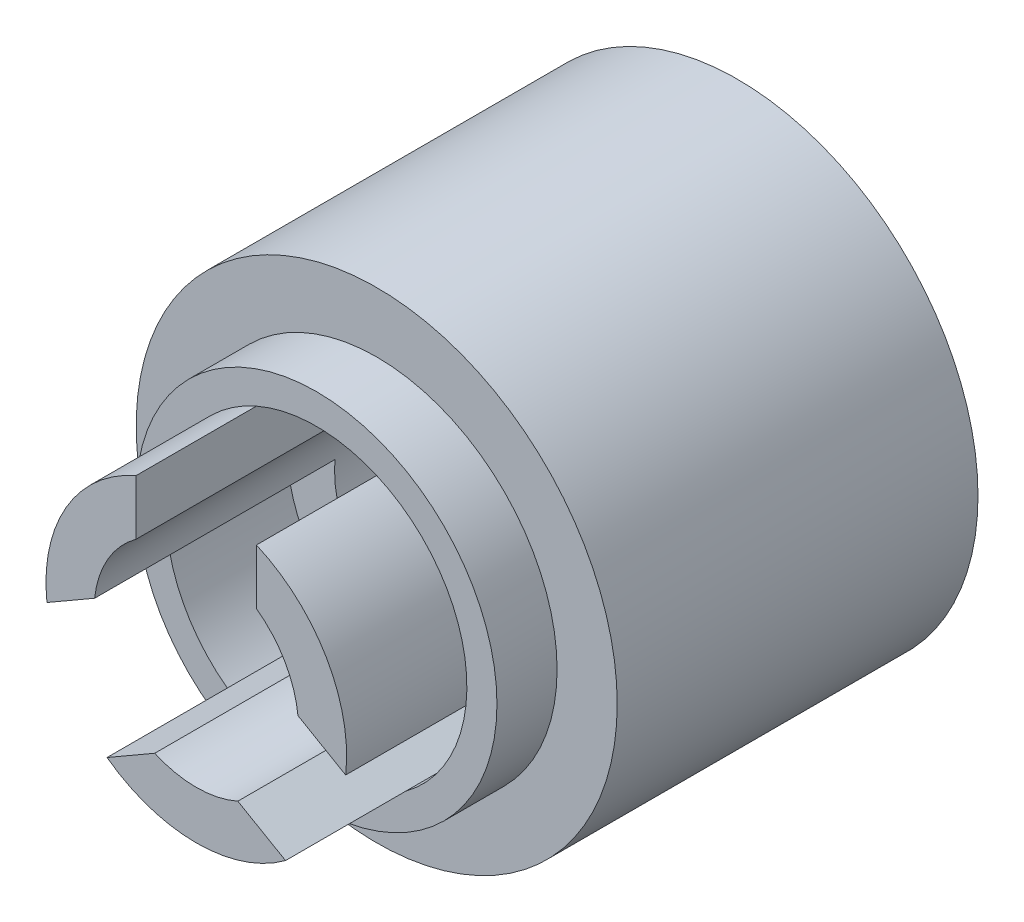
from build123d import *
from build123d.topology import SkipClean

# Parameters (mm, degrees)
SKETCH1_R           = 5.08
BOSS_EXTRUDE1_DEPTH = 7.62
SKETCH2_R           = 3.81
BOSS_EXTRUDE2_DEPTH = 1.27
SKETCH3_R           = 2.159
CUT_EXTRUDE1_DEPTH  = 12.43
SKETCH4_R           = 3.429
CUT_EXTRUDE2_DEPTH  = 5.08
BOSS_EXTRUDE3_DEPTH = 2.54
CUT_EXTRUDE5_START  = -1.27
CUT_EXTRUDE5_DEPTH  = 1.27


with BuildPart() as part:
    # Sketch1 → Boss-Extrude1 (new body)
    with BuildSketch(Plane.XY):
        Circle(SKETCH1_R)
    extrude(amount=-BOSS_EXTRUDE1_DEPTH)

    # Sketch2 → Boss-Extrude2 (add)
    with BuildSketch(Plane.XY):
        Circle(SKETCH2_R)
        with BuildLine():
            Line((-1.27, 0.842422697), (-1.27, 2.909935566))
            ThreePointArc((-1.27, 2.909935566), (0, 3.175), (1.27, 2.909935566))
            Line((1.27, 2.909935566), (1.27, 0.842422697))
            ThreePointArc((1.27, 0.842422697), (1.319822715, 0.762), (1.364559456, 0.678640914))
            Line((1.364559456, 0.678640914), (3.155078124, -0.35511552))
            ThreePointArc((3.155078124, -0.35511552), (2.749630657, -1.5875), (1.885078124, -2.554820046))
            Line((1.885078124, -2.554820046), (0.094559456, -1.521063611))
            ThreePointArc((0.094559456, -1.521063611), (0, -1.524), (-0.094559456, -1.521063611))
            Line((-0.094559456, -1.521063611), (-1.885078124, -2.554820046))
            ThreePointArc((-1.885078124, -2.554820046), (-2.749630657, -1.5875), (-3.155078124, -0.35511552))
            Line((-3.155078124, -0.35511552), (-1.364559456, 0.678640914))
            ThreePointArc((-1.364559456, 0.678640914), (-1.319822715, 0.762), (-1.27, 0.842422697))
        make_face(mode=Mode.SUBTRACT)
    extrude(amount=BOSS_EXTRUDE2_DEPTH)

    # Sketch3 → Cut-Extrude1 (cut, through all)
    with BuildSketch(Plane(origin=(0, 0, -7.62), x_dir=(-1, 0, 0), z_dir=(0, 0, -1))):
        Circle(SKETCH3_R)
    extrude(amount=-CUT_EXTRUDE1_DEPTH, mode=Mode.SUBTRACT)

    # Sketch4 → Cut-Extrude2 (cut)
    with BuildSketch(Plane(origin=(0, 0, -7.62), x_dir=(-1, 0, 0), z_dir=(0, 0, -1))):
        Circle(SKETCH4_R)
    extrude(amount=-CUT_EXTRUDE2_DEPTH, mode=Mode.SUBTRACT)

    # Sketch6 → Boss-Extrude3 (add)
    with SkipClean():  # the faces are left unmerged after this step: merging them gives an invalid solid
        with BuildSketch(Plane.XY.offset(1.27)):
            with BuildLine():
                Line((-1.27, 1.74596134), (-1.27, 2.909935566))
                ThreePointArc((-1.27, 2.909935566), (-2.749630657, 1.5875), (-3.155078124, -0.35511552))
                Line((-3.155078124, -0.35511552), (-2.147046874, 0.226871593))
                ThreePointArc((-2.147046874, 0.226871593), (-1.869748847, 1.0795), (-1.27, 1.74596134))
            make_face()
            with BuildLine():
                Line((1.27, 1.74596134), (1.27, 2.909935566))
                ThreePointArc((1.27, 2.909935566), (2.749630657, 1.5875), (3.155078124, -0.35511552))
                Line((3.155078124, -0.35511552), (2.147046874, 0.226871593))
                ThreePointArc((2.147046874, 0.226871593), (1.869748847, 1.0795), (1.27, 1.74596134))
            make_face()
            with BuildLine():
                Line((0.877046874, -1.972832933), (1.885078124, -2.554820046))
                ThreePointArc((1.885078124, -2.554820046), (0, -3.175), (-1.885078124, -2.554820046))
                Line((-1.885078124, -2.554820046), (-0.877046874, -1.972832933))
                ThreePointArc((-0.877046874, -1.972832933), (0, -2.159), (0.877046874, -1.972832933))
            make_face()
        extrude(amount=BOSS_EXTRUDE3_DEPTH)

    # Sketch7 → Cut-Extrude5 (cut)
    with SkipClean():  # the faces are left unmerged after this step: merging them gives an invalid solid
        with BuildSketch(Plane.XY.offset(CUT_EXTRUDE5_START)):
            with BuildLine():
                Line((1.27, 1.74596134), (1.27, 2.909935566))
                ThreePointArc((1.27, 2.909935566), (0, 3.175), (-1.27, 2.909935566))
                Line((-1.27, 2.909935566), (-1.27, 1.74596134))
                ThreePointArc((-1.27, 1.74596134), (0, 2.159), (1.27, 1.74596134))
            make_face()
            with BuildLine():
                Line((2.147046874, 0.226871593), (3.155078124, -0.35511552))
                ThreePointArc((3.155078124, -0.35511552), (2.749630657, -1.5875), (1.885078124, -2.554820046))
                Line((1.885078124, -2.554820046), (0.877046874, -1.972832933))
                ThreePointArc((0.877046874, -1.972832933), (1.869748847, -1.0795), (2.147046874, 0.226871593))
            make_face()
            with BuildLine():
                Line((-2.147046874, 0.226871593), (-3.155078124, -0.35511552))
                ThreePointArc((-3.155078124, -0.35511552), (-2.749630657, -1.5875), (-1.885078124, -2.554820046))
                Line((-1.885078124, -2.554820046), (-0.877046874, -1.972832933))
                ThreePointArc((-0.877046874, -1.972832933), (-1.869748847, -1.0795), (-2.147046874, 0.226871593))
            make_face()
        extrude(amount=CUT_EXTRUDE5_DEPTH, mode=Mode.SUBTRACT)


solid = part.part
